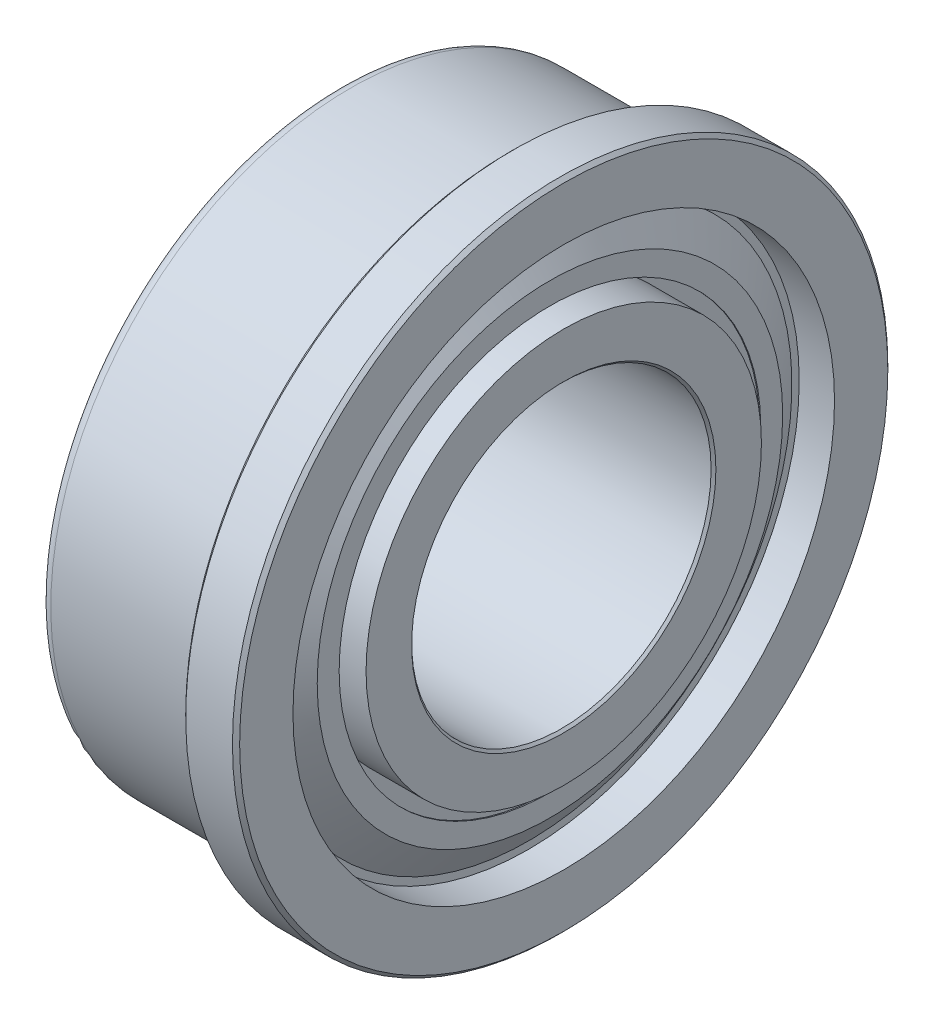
ISO-10303-21;
HEADER;
FILE_DESCRIPTION(('STEP AP214'),'2;1');
FILE_NAME('part.step','',(''),(''),'','','');
FILE_SCHEMA(('AUTOMOTIVE_DESIGN { 1 0 10303 214 1 1 1 1 }'));
ENDSEC;
DATA;
#1=APPLICATION_CONTEXT('core data for automotive mechanical design processes');
#2=APPLICATION_PROTOCOL_DEFINITION('international standard','automotive_design',2000,#1);
#3=PRODUCT_CONTEXT('',#1,'mechanical');
#4=PRODUCT('Part','Part','',(#3));
#5=PRODUCT_RELATED_PRODUCT_CATEGORY('part','',(#4));
#6=PRODUCT_DEFINITION_FORMATION('','',#4);
#7=PRODUCT_DEFINITION_CONTEXT('part definition',#1,'design');
#8=PRODUCT_DEFINITION('design','',#6,#7);
#9=PRODUCT_DEFINITION_SHAPE('','',#8);
#10=(LENGTH_UNIT() NAMED_UNIT(*) SI_UNIT(.MILLI.,.METRE.));
#11=(NAMED_UNIT(*) PLANE_ANGLE_UNIT() SI_UNIT($,.RADIAN.));
#12=(NAMED_UNIT(*) SI_UNIT($,.STERADIAN.) SOLID_ANGLE_UNIT());
#13=UNCERTAINTY_MEASURE_WITH_UNIT(LENGTH_MEASURE(1.E-05),#10,'distance_accuracy_value','');
#14=(GEOMETRIC_REPRESENTATION_CONTEXT(3) GLOBAL_UNCERTAINTY_ASSIGNED_CONTEXT((#13)) GLOBAL_UNIT_ASSIGNED_CONTEXT((#10,
#11,#12)) REPRESENTATION_CONTEXT('',''));
#15=CARTESIAN_POINT('',(0.,0.,0.));
#16=DIRECTION('',(0.,0.,1.));
#17=DIRECTION('',(1.,0.,0.));
#18=AXIS2_PLACEMENT_3D('',#15,#16,#17);
#19=CARTESIAN_POINT('',(2.38125,0.,0.));
#20=DIRECTION('',(1.,0.,0.));
#21=DIRECTION('',(0.,0.,-1.));
#22=AXIS2_PLACEMENT_3D('',#19,#20,#21);
#23=PLANE('',#22);
#24=CARTESIAN_POINT('',(2.38124999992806,0.,0.));
#25=DIRECTION('',(1.,0.,0.));
#26=DIRECTION('',(0.,0.,-1.));
#27=AXIS2_PLACEMENT_3D('',#24,#25,#26);
#28=CIRCLE('',#27,3.22580000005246);
#29=CARTESIAN_POINT('',(2.38124999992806,0.,-3.22580000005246));
#30=VERTEX_POINT('',#29);
#31=EDGE_CURVE('E184',#30,#30,#28,.F.);
#32=ORIENTED_EDGE('',*,*,#31,.T.);
#33=EDGE_LOOP('',(#32));
#34=FACE_BOUND('',#33,.T.);
#35=CARTESIAN_POINT('',(2.38125,0.,0.));
#36=DIRECTION('',(1.,0.,0.));
#37=DIRECTION('',(0.,0.,-1.));
#38=AXIS2_PLACEMENT_3D('',#35,#36,#37);
#39=CIRCLE('',#38,4.191);
#40=CARTESIAN_POINT('',(2.38125,0.,-4.191));
#41=VERTEX_POINT('',#40);
#42=EDGE_CURVE('E182',#41,#41,#39,.F.);
#43=ORIENTED_EDGE('',*,*,#42,.F.);
#44=EDGE_LOOP('',(#43));
#45=FACE_BOUND('',#44,.T.);
#46=ADVANCED_FACE('F16',(#34,#45),#23,.T.);
#47=CARTESIAN_POINT('',(2.38124999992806,0.,0.));
#48=DIRECTION('',(1.,0.,0.));
#49=DIRECTION('',(0.,0.,-1.));
#50=AXIS2_PLACEMENT_3D('',#47,#48,#49);
#51=CONICAL_SURFACE('',#50,3.22580000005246,0.785398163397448);
#52=ORIENTED_EDGE('',*,*,#31,.F.);
#53=EDGE_LOOP('',(#52));
#54=FACE_BOUND('',#53,.T.);
#55=CARTESIAN_POINT('',(2.33045,0.,0.));
#56=DIRECTION('',(1.,0.,0.));
#57=DIRECTION('',(0.,0.,-1.));
#58=AXIS2_PLACEMENT_3D('',#55,#56,#57);
#59=CIRCLE('',#58,3.175);
#60=CARTESIAN_POINT('',(2.33045,0.,-3.175));
#61=VERTEX_POINT('',#60);
#62=EDGE_CURVE('E101',#61,#61,#59,.F.);
#63=ORIENTED_EDGE('',*,*,#62,.T.);
#64=EDGE_LOOP('',(#63));
#65=FACE_BOUND('',#64,.T.);
#66=ADVANCED_FACE('F190',(#54,#65),#51,.F.);
#67=CARTESIAN_POINT('',(-2.619375,0.,0.));
#68=DIRECTION('',(1.,0.,0.));
#69=DIRECTION('',(0.,0.,-1.));
#70=AXIS2_PLACEMENT_3D('',#67,#68,#69);
#71=CYLINDRICAL_SURFACE('',#70,4.191);
#72=CARTESIAN_POINT('',(1.190625,0.,0.));
#73=DIRECTION('',(1.,0.,0.));
#74=DIRECTION('',(0.,0.,-1.));
#75=AXIS2_PLACEMENT_3D('',#72,#73,#74);
#76=CIRCLE('',#75,4.191);
#77=CARTESIAN_POINT('',(1.190625,0.,-4.191));
#78=VERTEX_POINT('',#77);
#79=EDGE_CURVE('E179',#78,#78,#76,.F.);
#80=ORIENTED_EDGE('',*,*,#79,.F.);
#81=EDGE_LOOP('',(#80));
#82=FACE_BOUND('',#81,.T.);
#83=ORIENTED_EDGE('',*,*,#42,.T.);
#84=EDGE_LOOP('',(#83));
#85=FACE_BOUND('',#84,.T.);
#86=ADVANCED_FACE('F193',(#82,#85),#71,.T.);
#87=CARTESIAN_POINT('',(-2.619375,0.,0.));
#88=DIRECTION('',(1.,0.,0.));
#89=DIRECTION('',(0.,0.,-1.));
#90=AXIS2_PLACEMENT_3D('',#87,#88,#89);
#91=CYLINDRICAL_SURFACE('',#90,3.175);
#92=ORIENTED_EDGE('',*,*,#62,.F.);
#93=EDGE_LOOP('',(#92));
#94=FACE_BOUND('',#93,.T.);
#95=CARTESIAN_POINT('',(-2.33044999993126,0.,0.));
#96=DIRECTION('',(-1.,0.,0.));
#97=DIRECTION('',(0.,1.,0.));
#98=AXIS2_PLACEMENT_3D('',#95,#96,#97);
#99=CIRCLE('',#98,3.17500000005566);
#100=CARTESIAN_POINT('',(-2.33044999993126,3.17500000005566,0.));
#101=VERTEX_POINT('',#100);
#102=EDGE_CURVE('E178',#101,#101,#99,.T.);
#103=ORIENTED_EDGE('',*,*,#102,.T.);
#104=EDGE_LOOP('',(#103));
#105=FACE_BOUND('',#104,.T.);
#106=ADVANCED_FACE('F197',(#94,#105),#91,.F.);
#107=CARTESIAN_POINT('',(1.190625,0.,0.));
#108=DIRECTION('',(1.,0.,0.));
#109=DIRECTION('',(0.,0.,-1.));
#110=AXIS2_PLACEMENT_3D('',#107,#108,#109);
#111=PLANE('',#110);
#112=ORIENTED_EDGE('',*,*,#79,.T.);
#113=EDGE_LOOP('',(#112));
#114=FACE_BOUND('',#113,.T.);
#115=CARTESIAN_POINT('',(1.190625,0.,0.));
#116=DIRECTION('',(1.,0.,0.));
#117=DIRECTION('',(0.,0.,-1.));
#118=AXIS2_PLACEMENT_3D('',#115,#116,#117);
#119=CIRCLE('',#118,5.7404);
#120=CARTESIAN_POINT('',(1.190625,0.,-5.7404));
#121=VERTEX_POINT('',#120);
#122=EDGE_CURVE('E175',#121,#121,#119,.T.);
#123=ORIENTED_EDGE('',*,*,#122,.T.);
#124=EDGE_LOOP('',(#123));
#125=FACE_BOUND('',#124,.T.);
#126=ADVANCED_FACE('F200',(#114,#125),#111,.T.);
#127=CARTESIAN_POINT('',(-2.38124999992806,0.,0.));
#128=DIRECTION('',(-1.,0.,0.));
#129=DIRECTION('',(0.,0.,1.));
#130=AXIS2_PLACEMENT_3D('',#127,#128,#129);
#131=CONICAL_SURFACE('',#130,3.22580000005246,0.785398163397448);
#132=ORIENTED_EDGE('',*,*,#102,.F.);
#133=EDGE_LOOP('',(#132));
#134=FACE_BOUND('',#133,.T.);
#135=CARTESIAN_POINT('',(-2.38124999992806,0.,0.));
#136=DIRECTION('',(-1.,0.,0.));
#137=DIRECTION('',(0.,0.,1.));
#138=AXIS2_PLACEMENT_3D('',#135,#136,#137);
#139=CIRCLE('',#138,3.22580000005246);
#140=CARTESIAN_POINT('',(-2.38124999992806,0.,3.22580000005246));
#141=VERTEX_POINT('',#140);
#142=EDGE_CURVE('E172',#141,#141,#139,.T.);
#143=ORIENTED_EDGE('',*,*,#142,.T.);
#144=EDGE_LOOP('',(#143));
#145=FACE_BOUND('',#144,.T.);
#146=ADVANCED_FACE('F309',(#134,#145),#131,.F.);
#147=CARTESIAN_POINT('',(-2.619375,0.,0.));
#148=DIRECTION('',(1.,0.,0.));
#149=DIRECTION('',(0.,0.,-1.));
#150=AXIS2_PLACEMENT_3D('',#147,#148,#149);
#151=CYLINDRICAL_SURFACE('',#150,5.7404);
#152=ORIENTED_EDGE('',*,*,#122,.F.);
#153=EDGE_LOOP('',(#152));
#154=FACE_BOUND('',#153,.T.);
#155=CARTESIAN_POINT('',(1.60734375,0.,0.));
#156=DIRECTION('',(1.,0.,0.));
#157=DIRECTION('',(0.,0.,-1.));
#158=AXIS2_PLACEMENT_3D('',#155,#156,#157);
#159=CIRCLE('',#158,5.7404);
#160=CARTESIAN_POINT('',(1.60734375,0.,-5.7404));
#161=VERTEX_POINT('',#160);
#162=EDGE_CURVE('E169',#161,#161,#159,.T.);
#163=ORIENTED_EDGE('',*,*,#162,.T.);
#164=EDGE_LOOP('',(#163));
#165=FACE_BOUND('',#164,.T.);
#166=ADVANCED_FACE('F305',(#154,#165),#151,.F.);
#167=CARTESIAN_POINT('',(-2.38125,0.,0.));
#168=DIRECTION('',(1.,0.,0.));
#169=DIRECTION('',(0.,0.,-1.));
#170=AXIS2_PLACEMENT_3D('',#167,#168,#169);
#171=PLANE('',#170);
#172=ORIENTED_EDGE('',*,*,#142,.F.);
#173=EDGE_LOOP('',(#172));
#174=FACE_BOUND('',#173,.T.);
#175=CARTESIAN_POINT('',(-2.38125,0.,0.));
#176=DIRECTION('',(1.,0.,0.));
#177=DIRECTION('',(0.,0.,-1.));
#178=AXIS2_PLACEMENT_3D('',#175,#176,#177);
#179=CIRCLE('',#178,4.191);
#180=CARTESIAN_POINT('',(-2.38125,0.,-4.191));
#181=VERTEX_POINT('',#180);
#182=EDGE_CURVE('E166',#181,#181,#179,.T.);
#183=ORIENTED_EDGE('',*,*,#182,.F.);
#184=EDGE_LOOP('',(#183));
#185=FACE_BOUND('',#184,.T.);
#186=ADVANCED_FACE('F301',(#174,#185),#171,.F.);
#187=CARTESIAN_POINT('',(1.60734375,0.,0.));
#188=DIRECTION('',(1.,0.,0.));
#189=DIRECTION('',(0.,0.,-1.));
#190=AXIS2_PLACEMENT_3D('',#187,#188,#189);
#191=PLANE('',#190);
#192=CARTESIAN_POINT('',(1.60734375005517,0.,0.));
#193=DIRECTION('',(-1.,0.,0.));
#194=DIRECTION('',(0.,0.,1.));
#195=AXIS2_PLACEMENT_3D('',#192,#193,#194);
#196=CIRCLE('',#195,5.57745141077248);
#197=CARTESIAN_POINT('',(1.60734375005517,0.,5.57745141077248));
#198=VERTEX_POINT('',#197);
#199=EDGE_CURVE('E163',#198,#198,#196,.F.);
#200=ORIENTED_EDGE('',*,*,#199,.T.);
#201=EDGE_LOOP('',(#200));
#202=FACE_BOUND('',#201,.T.);
#203=ORIENTED_EDGE('',*,*,#162,.F.);
#204=EDGE_LOOP('',(#203));
#205=FACE_BOUND('',#204,.T.);
#206=ADVANCED_FACE('F297',(#202,#205),#191,.F.);
#207=CARTESIAN_POINT('',(-2.619375,0.,0.));
#208=DIRECTION('',(1.,0.,0.));
#209=DIRECTION('',(0.,0.,-1.));
#210=AXIS2_PLACEMENT_3D('',#207,#208,#209);
#211=CYLINDRICAL_SURFACE('',#210,4.191);
#212=ORIENTED_EDGE('',*,*,#182,.T.);
#213=EDGE_LOOP('',(#212));
#214=FACE_BOUND('',#213,.T.);
#215=CARTESIAN_POINT('',(-1.190625,0.,0.));
#216=DIRECTION('',(1.,0.,0.));
#217=DIRECTION('',(0.,0.,-1.));
#218=AXIS2_PLACEMENT_3D('',#215,#216,#217);
#219=CIRCLE('',#218,4.191);
#220=CARTESIAN_POINT('',(-1.190625,0.,-4.191));
#221=VERTEX_POINT('',#220);
#222=EDGE_CURVE('E160',#221,#221,#219,.F.);
#223=ORIENTED_EDGE('',*,*,#222,.T.);
#224=EDGE_LOOP('',(#223));
#225=FACE_BOUND('',#224,.T.);
#226=ADVANCED_FACE('F293',(#214,#225),#211,.T.);
#227=CARTESIAN_POINT('',(1.60734375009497,0.,0.));
#228=DIRECTION('',(-1.,0.,0.));
#229=DIRECTION('',(0.,0.,1.));
#230=AXIS2_PLACEMENT_3D('',#227,#228,#229);
#231=CONICAL_SURFACE('',#230,5.57745141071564,0.959931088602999);
#232=ORIENTED_EDGE('',*,*,#199,.F.);
#233=EDGE_LOOP('',(#232));
#234=FACE_BOUND('',#233,.T.);
#235=CARTESIAN_POINT('',(2.0635359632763,0.,0.));
#236=DIRECTION('',(-1.,0.,0.));
#237=DIRECTION('',(0.,0.,1.));
#238=AXIS2_PLACEMENT_3D('',#235,#236,#237);
#239=CIRCLE('',#238,4.92594141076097);
#240=CARTESIAN_POINT('',(2.0635359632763,0.,4.92594141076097));
#241=VERTEX_POINT('',#240);
#242=EDGE_CURVE('E157',#241,#241,#239,.F.);
#243=ORIENTED_EDGE('',*,*,#242,.T.);
#244=EDGE_LOOP('',(#243));
#245=FACE_BOUND('',#244,.T.);
#246=ADVANCED_FACE('F289',(#234,#245),#231,.F.);
#247=CARTESIAN_POINT('',(-1.190625,0.,0.));
#248=DIRECTION('',(1.,0.,0.));
#249=DIRECTION('',(0.,0.,-1.));
#250=AXIS2_PLACEMENT_3D('',#247,#248,#249);
#251=PLANE('',#250);
#252=ORIENTED_EDGE('',*,*,#222,.F.);
#253=EDGE_LOOP('',(#252));
#254=FACE_BOUND('',#253,.T.);
#255=CARTESIAN_POINT('',(-1.190625,0.,0.));
#256=DIRECTION('',(1.,0.,0.));
#257=DIRECTION('',(0.,0.,-1.));
#258=AXIS2_PLACEMENT_3D('',#255,#256,#257);
#259=CIRCLE('',#258,5.7404);
#260=CARTESIAN_POINT('',(-1.190625,0.,-5.7404));
#261=VERTEX_POINT('',#260);
#262=EDGE_CURVE('E154',#261,#261,#259,.F.);
#263=ORIENTED_EDGE('',*,*,#262,.T.);
#264=EDGE_LOOP('',(#263));
#265=FACE_BOUND('',#264,.T.);
#266=ADVANCED_FACE('F285',(#254,#265),#251,.F.);
#267=CARTESIAN_POINT('',(2.06353596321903,0.,0.));
#268=DIRECTION('',(1.,0.,0.));
#269=DIRECTION('',(0.,0.,-1.));
#270=AXIS2_PLACEMENT_3D('',#267,#268,#269);
#271=PLANE('',#270);
#272=CARTESIAN_POINT('',(2.06353596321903,0.,0.));
#273=DIRECTION('',(1.,0.,0.));
#274=DIRECTION('',(0.,0.,-1.));
#275=AXIS2_PLACEMENT_3D('',#272,#273,#274);
#276=CIRCLE('',#275,4.46913);
#277=CARTESIAN_POINT('',(2.06353596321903,0.,-4.46913));
#278=VERTEX_POINT('',#277);
#279=EDGE_CURVE('E151',#278,#278,#276,.T.);
#280=ORIENTED_EDGE('',*,*,#279,.T.);
#281=EDGE_LOOP('',(#280));
#282=FACE_BOUND('',#281,.T.);
#283=ORIENTED_EDGE('',*,*,#242,.F.);
#284=EDGE_LOOP('',(#283));
#285=FACE_BOUND('',#284,.T.);
#286=ADVANCED_FACE('F281',(#282,#285),#271,.F.);
#287=CARTESIAN_POINT('',(-2.619375,0.,0.));
#288=DIRECTION('',(1.,0.,0.));
#289=DIRECTION('',(0.,0.,-1.));
#290=AXIS2_PLACEMENT_3D('',#287,#288,#289);
#291=CYLINDRICAL_SURFACE('',#290,5.7404);
#292=ORIENTED_EDGE('',*,*,#262,.F.);
#293=EDGE_LOOP('',(#292));
#294=FACE_BOUND('',#293,.T.);
#295=CARTESIAN_POINT('',(-1.60734375,0.,0.));
#296=DIRECTION('',(1.,0.,0.));
#297=DIRECTION('',(0.,0.,-1.));
#298=AXIS2_PLACEMENT_3D('',#295,#296,#297);
#299=CIRCLE('',#298,5.7404);
#300=CARTESIAN_POINT('',(-1.60734375,0.,-5.7404));
#301=VERTEX_POINT('',#300);
#302=EDGE_CURVE('E148',#301,#301,#299,.T.);
#303=ORIENTED_EDGE('',*,*,#302,.F.);
#304=EDGE_LOOP('',(#303));
#305=FACE_BOUND('',#304,.T.);
#306=ADVANCED_FACE('F277',(#294,#305),#291,.F.);
#307=CARTESIAN_POINT('',(1.58326413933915,0.,0.));
#308=DIRECTION('',(1.,0.,0.));
#309=DIRECTION('',(0.,0.,-1.));
#310=AXIS2_PLACEMENT_3D('',#307,#308,#309);
#311=CYLINDRICAL_SURFACE('',#310,4.46913);
#312=CARTESIAN_POINT('',(2.08893596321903,0.,0.));
#313=DIRECTION('',(1.,0.,0.));
#314=DIRECTION('',(0.,0.,-1.));
#315=AXIS2_PLACEMENT_3D('',#312,#313,#314);
#316=CIRCLE('',#315,4.46913);
#317=CARTESIAN_POINT('',(2.08893596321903,0.,-4.46913));
#318=VERTEX_POINT('',#317);
#319=EDGE_CURVE('E145',#318,#318,#316,.F.);
#320=ORIENTED_EDGE('',*,*,#319,.F.);
#321=EDGE_LOOP('',(#320));
#322=FACE_BOUND('',#321,.T.);
#323=ORIENTED_EDGE('',*,*,#279,.F.);
#324=EDGE_LOOP('',(#323));
#325=FACE_BOUND('',#324,.T.);
#326=ADVANCED_FACE('F273',(#322,#325),#311,.F.);
#327=CARTESIAN_POINT('',(-1.60734375,0.,0.));
#328=DIRECTION('',(1.,0.,0.));
#329=DIRECTION('',(0.,0.,-1.));
#330=AXIS2_PLACEMENT_3D('',#327,#328,#329);
#331=PLANE('',#330);
#332=CARTESIAN_POINT('',(-1.60734375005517,0.,0.));
#333=DIRECTION('',(1.,0.,0.));
#334=DIRECTION('',(0.,0.,-1.));
#335=AXIS2_PLACEMENT_3D('',#332,#333,#334);
#336=CIRCLE('',#335,5.57745141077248);
#337=CARTESIAN_POINT('',(-1.60734375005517,0.,-5.57745141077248));
#338=VERTEX_POINT('',#337);
#339=EDGE_CURVE('E142',#338,#338,#336,.F.);
#340=ORIENTED_EDGE('',*,*,#339,.T.);
#341=EDGE_LOOP('',(#340));
#342=FACE_BOUND('',#341,.T.);
#343=ORIENTED_EDGE('',*,*,#302,.T.);
#344=EDGE_LOOP('',(#343));
#345=FACE_BOUND('',#344,.T.);
#346=ADVANCED_FACE('F269',(#342,#345),#331,.T.);
#347=CARTESIAN_POINT('',(2.08893596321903,0.,0.));
#348=DIRECTION('',(1.,0.,0.));
#349=DIRECTION('',(0.,0.,-1.));
#350=AXIS2_PLACEMENT_3D('',#347,#348,#349);
#351=PLANE('',#350);
#352=ORIENTED_EDGE('',*,*,#319,.T.);
#353=EDGE_LOOP('',(#352));
#354=FACE_BOUND('',#353,.T.);
#355=CARTESIAN_POINT('',(2.08893596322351,0.,0.));
#356=DIRECTION('',(-1.,0.,0.));
#357=DIRECTION('',(0.,0.,1.));
#358=AXIS2_PLACEMENT_3D('',#355,#356,#357);
#359=CIRCLE('',#358,4.93394999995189);
#360=CARTESIAN_POINT('',(2.08893596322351,0.,4.93394999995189));
#361=VERTEX_POINT('',#360);
#362=EDGE_CURVE('E139',#361,#361,#359,.T.);
#363=ORIENTED_EDGE('',*,*,#362,.F.);
#364=EDGE_LOOP('',(#363));
#365=FACE_BOUND('',#364,.T.);
#366=ADVANCED_FACE('F265',(#354,#365),#351,.T.);
#367=CARTESIAN_POINT('',(-1.60734375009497,0.,0.));
#368=DIRECTION('',(1.,0.,0.));
#369=DIRECTION('',(0.,0.,-1.));
#370=AXIS2_PLACEMENT_3D('',#367,#368,#369);
#371=CONICAL_SURFACE('',#370,5.57745141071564,0.959931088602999);
#372=ORIENTED_EDGE('',*,*,#339,.F.);
#373=EDGE_LOOP('',(#372));
#374=FACE_BOUND('',#373,.T.);
#375=CARTESIAN_POINT('',(-2.0635359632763,0.,0.));
#376=DIRECTION('',(1.,0.,0.));
#377=DIRECTION('',(0.,0.,-1.));
#378=AXIS2_PLACEMENT_3D('',#375,#376,#377);
#379=CIRCLE('',#378,4.92594141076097);
#380=CARTESIAN_POINT('',(-2.0635359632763,0.,-4.92594141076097));
#381=VERTEX_POINT('',#380);
#382=EDGE_CURVE('E136',#381,#381,#379,.T.);
#383=ORIENTED_EDGE('',*,*,#382,.F.);
#384=EDGE_LOOP('',(#383));
#385=FACE_BOUND('',#384,.T.);
#386=ADVANCED_FACE('F261',(#374,#385),#371,.F.);
#387=CARTESIAN_POINT('',(1.63274375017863,0.,0.));
#388=DIRECTION('',(-1.,0.,0.));
#389=DIRECTION('',(0.,0.,1.));
#390=AXIS2_PLACEMENT_3D('',#387,#388,#389);
#391=CONICAL_SURFACE('',#390,5.58545999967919,0.959931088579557);
#392=CARTESIAN_POINT('',(1.63274374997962,0.,0.));
#393=DIRECTION('',(-1.,0.,0.));
#394=DIRECTION('',(0.,0.,1.));
#395=AXIS2_PLACEMENT_3D('',#392,#393,#394);
#396=CIRCLE('',#395,5.5854599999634);
#397=CARTESIAN_POINT('',(1.63274374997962,0.,5.5854599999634));
#398=VERTEX_POINT('',#397);
#399=EDGE_CURVE('E133',#398,#398,#396,.T.);
#400=ORIENTED_EDGE('',*,*,#399,.F.);
#401=EDGE_LOOP('',(#400));
#402=FACE_BOUND('',#401,.T.);
#403=ORIENTED_EDGE('',*,*,#362,.T.);
#404=EDGE_LOOP('',(#403));
#405=FACE_BOUND('',#404,.T.);
#406=ADVANCED_FACE('F257',(#402,#405),#391,.T.);
#407=CARTESIAN_POINT('',(-2.06353596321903,0.,0.));
#408=DIRECTION('',(1.,0.,0.));
#409=DIRECTION('',(0.,0.,-1.));
#410=AXIS2_PLACEMENT_3D('',#407,#408,#409);
#411=PLANE('',#410);
#412=CARTESIAN_POINT('',(-2.06353596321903,0.,0.));
#413=DIRECTION('',(1.,0.,0.));
#414=DIRECTION('',(0.,0.,-1.));
#415=AXIS2_PLACEMENT_3D('',#412,#413,#414);
#416=CIRCLE('',#415,4.46913);
#417=CARTESIAN_POINT('',(-2.06353596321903,0.,-4.46913));
#418=VERTEX_POINT('',#417);
#419=EDGE_CURVE('E130',#418,#418,#416,.F.);
#420=ORIENTED_EDGE('',*,*,#419,.T.);
#421=EDGE_LOOP('',(#420));
#422=FACE_BOUND('',#421,.T.);
#423=ORIENTED_EDGE('',*,*,#382,.T.);
#424=EDGE_LOOP('',(#423));
#425=FACE_BOUND('',#424,.T.);
#426=ADVANCED_FACE('F253',(#422,#425),#411,.T.);
#427=CARTESIAN_POINT('',(1.63274375,0.,0.));
#428=DIRECTION('',(1.,0.,0.));
#429=DIRECTION('',(0.,0.,-1.));
#430=AXIS2_PLACEMENT_3D('',#427,#428,#429);
#431=PLANE('',#430);
#432=ORIENTED_EDGE('',*,*,#399,.T.);
#433=EDGE_LOOP('',(#432));
#434=FACE_BOUND('',#433,.T.);
#435=CARTESIAN_POINT('',(1.63274375,0.,0.));
#436=DIRECTION('',(1.,0.,0.));
#437=DIRECTION('',(0.,0.,-1.));
#438=AXIS2_PLACEMENT_3D('',#435,#436,#437);
#439=CIRCLE('',#438,5.7404);
#440=CARTESIAN_POINT('',(1.63274375,0.,-5.7404));
#441=VERTEX_POINT('',#440);
#442=EDGE_CURVE('E127',#441,#441,#439,.T.);
#443=ORIENTED_EDGE('',*,*,#442,.T.);
#444=EDGE_LOOP('',(#443));
#445=FACE_BOUND('',#444,.T.);
#446=ADVANCED_FACE('F249',(#434,#445),#431,.T.);
#447=CARTESIAN_POINT('',(-1.58326413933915,0.,0.));
#448=DIRECTION('',(1.,0.,0.));
#449=DIRECTION('',(0.,0.,-1.));
#450=AXIS2_PLACEMENT_3D('',#447,#448,#449);
#451=CYLINDRICAL_SURFACE('',#450,4.46913);
#452=CARTESIAN_POINT('',(-2.08893596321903,0.,0.));
#453=DIRECTION('',(1.,0.,0.));
#454=DIRECTION('',(0.,0.,-1.));
#455=AXIS2_PLACEMENT_3D('',#452,#453,#454);
#456=CIRCLE('',#455,4.46913);
#457=CARTESIAN_POINT('',(-2.08893596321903,0.,-4.46913));
#458=VERTEX_POINT('',#457);
#459=EDGE_CURVE('E124',#458,#458,#456,.F.);
#460=ORIENTED_EDGE('',*,*,#459,.T.);
#461=EDGE_LOOP('',(#460));
#462=FACE_BOUND('',#461,.T.);
#463=ORIENTED_EDGE('',*,*,#419,.F.);
#464=EDGE_LOOP('',(#463));
#465=FACE_BOUND('',#464,.T.);
#466=ADVANCED_FACE('F245',(#462,#465),#451,.F.);
#467=CARTESIAN_POINT('',(-2.619375,0.,0.));
#468=DIRECTION('',(1.,0.,0.));
#469=DIRECTION('',(0.,0.,-1.));
#470=AXIS2_PLACEMENT_3D('',#467,#468,#469);
#471=CYLINDRICAL_SURFACE('',#470,5.7404);
#472=CARTESIAN_POINT('',(2.38125,0.,0.));
#473=DIRECTION('',(1.,0.,0.));
#474=DIRECTION('',(0.,0.,-1.));
#475=AXIS2_PLACEMENT_3D('',#472,#473,#474);
#476=CIRCLE('',#475,5.7404);
#477=CARTESIAN_POINT('',(2.38125,0.,-5.7404));
#478=VERTEX_POINT('',#477);
#479=EDGE_CURVE('E121',#478,#478,#476,.F.);
#480=ORIENTED_EDGE('',*,*,#479,.F.);
#481=EDGE_LOOP('',(#480));
#482=FACE_BOUND('',#481,.T.);
#483=ORIENTED_EDGE('',*,*,#442,.F.);
#484=EDGE_LOOP('',(#483));
#485=FACE_BOUND('',#484,.T.);
#486=ADVANCED_FACE('F241',(#482,#485),#471,.F.);
#487=CARTESIAN_POINT('',(-2.08893596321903,0.,0.));
#488=DIRECTION('',(1.,0.,0.));
#489=DIRECTION('',(0.,0.,-1.));
#490=AXIS2_PLACEMENT_3D('',#487,#488,#489);
#491=PLANE('',#490);
#492=ORIENTED_EDGE('',*,*,#459,.F.);
#493=EDGE_LOOP('',(#492));
#494=FACE_BOUND('',#493,.T.);
#495=CARTESIAN_POINT('',(-2.08893596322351,0.,0.));
#496=DIRECTION('',(1.,0.,0.));
#497=DIRECTION('',(0.,0.,-1.));
#498=AXIS2_PLACEMENT_3D('',#495,#496,#497);
#499=CIRCLE('',#498,4.93394999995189);
#500=CARTESIAN_POINT('',(-2.08893596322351,0.,-4.93394999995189));
#501=VERTEX_POINT('',#500);
#502=EDGE_CURVE('E118',#501,#501,#499,.T.);
#503=ORIENTED_EDGE('',*,*,#502,.F.);
#504=EDGE_LOOP('',(#503));
#505=FACE_BOUND('',#504,.T.);
#506=ADVANCED_FACE('F237',(#494,#505),#491,.F.);
#507=CARTESIAN_POINT('',(2.38125,0.,0.));
#508=DIRECTION('',(1.,0.,0.));
#509=DIRECTION('',(0.,0.,-1.));
#510=AXIS2_PLACEMENT_3D('',#507,#508,#509);
#511=PLANE('',#510);
#512=ORIENTED_EDGE('',*,*,#479,.T.);
#513=EDGE_LOOP('',(#512));
#514=FACE_BOUND('',#513,.T.);
#515=CARTESIAN_POINT('',(2.3812499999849,0.,0.));
#516=DIRECTION('',(-1.,0.,0.));
#517=DIRECTION('',(0.,0.,1.));
#518=AXIS2_PLACEMENT_3D('',#515,#516,#517);
#519=CIRCLE('',#518,6.87070000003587);
#520=CARTESIAN_POINT('',(2.3812499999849,0.,6.87070000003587));
#521=VERTEX_POINT('',#520);
#522=EDGE_CURVE('E115',#521,#521,#519,.T.);
#523=ORIENTED_EDGE('',*,*,#522,.F.);
#524=EDGE_LOOP('',(#523));
#525=FACE_BOUND('',#524,.T.);
#526=ADVANCED_FACE('F233',(#514,#525),#511,.T.);
#527=CARTESIAN_POINT('',(-1.63274375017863,0.,0.));
#528=DIRECTION('',(1.,0.,0.));
#529=DIRECTION('',(0.,0.,-1.));
#530=AXIS2_PLACEMENT_3D('',#527,#528,#529);
#531=CONICAL_SURFACE('',#530,5.58545999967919,0.959931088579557);
#532=CARTESIAN_POINT('',(-1.63274374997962,0.,0.));
#533=DIRECTION('',(1.,0.,0.));
#534=DIRECTION('',(0.,0.,-1.));
#535=AXIS2_PLACEMENT_3D('',#532,#533,#534);
#536=CIRCLE('',#535,5.5854599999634);
#537=CARTESIAN_POINT('',(-1.63274374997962,0.,-5.5854599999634));
#538=VERTEX_POINT('',#537);
#539=EDGE_CURVE('E112',#538,#538,#536,.F.);
#540=ORIENTED_EDGE('',*,*,#539,.T.);
#541=EDGE_LOOP('',(#540));
#542=FACE_BOUND('',#541,.T.);
#543=ORIENTED_EDGE('',*,*,#502,.T.);
#544=EDGE_LOOP('',(#543));
#545=FACE_BOUND('',#544,.T.);
#546=ADVANCED_FACE('F229',(#542,#545),#531,.T.);
#547=CARTESIAN_POINT('',(2.30505000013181,0.,0.));
#548=DIRECTION('',(-1.,0.,0.));
#549=DIRECTION('',(0.,0.,1.));
#550=AXIS2_PLACEMENT_3D('',#547,#548,#549);
#551=CONICAL_SURFACE('',#550,6.94689999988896,0.785398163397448);
#552=ORIENTED_EDGE('',*,*,#522,.T.);
#553=EDGE_LOOP('',(#552));
#554=FACE_BOUND('',#553,.T.);
#555=CARTESIAN_POINT('',(2.30505,0.,0.));
#556=DIRECTION('',(1.,0.,0.));
#557=DIRECTION('',(0.,0.,-1.));
#558=AXIS2_PLACEMENT_3D('',#555,#556,#557);
#559=CIRCLE('',#558,6.9469);
#560=CARTESIAN_POINT('',(2.30505,0.,-6.9469));
#561=VERTEX_POINT('',#560);
#562=EDGE_CURVE('E111',#561,#561,#559,.F.);
#563=ORIENTED_EDGE('',*,*,#562,.F.);
#564=EDGE_LOOP('',(#563));
#565=FACE_BOUND('',#564,.T.);
#566=ADVANCED_FACE('F223',(#554,#565),#551,.T.);
#567=CARTESIAN_POINT('',(-1.63274375,0.,0.));
#568=DIRECTION('',(1.,0.,0.));
#569=DIRECTION('',(0.,0.,-1.));
#570=AXIS2_PLACEMENT_3D('',#567,#568,#569);
#571=PLANE('',#570);
#572=ORIENTED_EDGE('',*,*,#539,.F.);
#573=EDGE_LOOP('',(#572));
#574=FACE_BOUND('',#573,.T.);
#575=CARTESIAN_POINT('',(-1.63274375,0.,0.));
#576=DIRECTION('',(1.,0.,0.));
#577=DIRECTION('',(0.,0.,-1.));
#578=AXIS2_PLACEMENT_3D('',#575,#576,#577);
#579=CIRCLE('',#578,5.7404);
#580=CARTESIAN_POINT('',(-1.63274375,0.,-5.7404));
#581=VERTEX_POINT('',#580);
#582=EDGE_CURVE('E108',#581,#581,#579,.F.);
#583=ORIENTED_EDGE('',*,*,#582,.T.);
#584=EDGE_LOOP('',(#583));
#585=FACE_BOUND('',#584,.T.);
#586=ADVANCED_FACE('F215',(#574,#585),#571,.F.);
#587=CARTESIAN_POINT('',(-2.619375,0.,0.));
#588=DIRECTION('',(1.,0.,0.));
#589=DIRECTION('',(0.,0.,-1.));
#590=AXIS2_PLACEMENT_3D('',#587,#588,#589);
#591=CYLINDRICAL_SURFACE('',#590,6.9469);
#592=ORIENTED_EDGE('',*,*,#562,.T.);
#593=EDGE_LOOP('',(#592));
#594=FACE_BOUND('',#593,.T.);
#595=CARTESIAN_POINT('',(1.31444999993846,0.,0.));
#596=DIRECTION('',(1.,0.,0.));
#597=DIRECTION('',(0.,-1.,0.));
#598=AXIS2_PLACEMENT_3D('',#595,#596,#597);
#599=CIRCLE('',#598,6.94690000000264);
#600=CARTESIAN_POINT('',(1.31444999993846,-6.94690000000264,0.));
#601=VERTEX_POINT('',#600);
#602=EDGE_CURVE('E107',#601,#601,#599,.F.);
#603=ORIENTED_EDGE('',*,*,#602,.F.);
#604=EDGE_LOOP('',(#603));
#605=FACE_BOUND('',#604,.T.);
#606=ADVANCED_FACE('F212',(#594,#605),#591,.T.);
#607=CARTESIAN_POINT('',(-2.619375,0.,0.));
#608=DIRECTION('',(1.,0.,0.));
#609=DIRECTION('',(0.,0.,-1.));
#610=AXIS2_PLACEMENT_3D('',#607,#608,#609);
#611=CYLINDRICAL_SURFACE('',#610,5.7404);
#612=CARTESIAN_POINT('',(-2.38125,0.,0.));
#613=DIRECTION('',(1.,0.,0.));
#614=DIRECTION('',(0.,0.,-1.));
#615=AXIS2_PLACEMENT_3D('',#612,#613,#614);
#616=CIRCLE('',#615,5.7404);
#617=CARTESIAN_POINT('',(-2.38125,0.,-5.7404));
#618=VERTEX_POINT('',#617);
#619=EDGE_CURVE('E42',#618,#618,#616,.F.);
#620=ORIENTED_EDGE('',*,*,#619,.T.);
#621=EDGE_LOOP('',(#620));
#622=FACE_BOUND('',#621,.T.);
#623=ORIENTED_EDGE('',*,*,#582,.F.);
#624=EDGE_LOOP('',(#623));
#625=FACE_BOUND('',#624,.T.);
#626=ADVANCED_FACE('F214',(#622,#625),#611,.F.);
#627=CARTESIAN_POINT('',(1.31444999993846,0.,0.));
#628=DIRECTION('',(1.,0.,0.));
#629=DIRECTION('',(0.,0.,-1.));
#630=AXIS2_PLACEMENT_3D('',#627,#628,#629);
#631=CONICAL_SURFACE('',#630,6.94690000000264,0.785398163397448);
#632=ORIENTED_EDGE('',*,*,#602,.T.);
#633=EDGE_LOOP('',(#632));
#634=FACE_BOUND('',#633,.T.);
#635=CARTESIAN_POINT('',(1.23824999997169,0.,0.));
#636=DIRECTION('',(1.,0.,0.));
#637=DIRECTION('',(0.,0.,-1.));
#638=AXIS2_PLACEMENT_3D('',#635,#636,#637);
#639=CIRCLE('',#638,6.87070000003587);
#640=CARTESIAN_POINT('',(1.23824999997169,0.,-6.87070000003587));
#641=VERTEX_POINT('',#640);
#642=EDGE_CURVE('E41',#641,#641,#639,.T.);
#643=ORIENTED_EDGE('',*,*,#642,.T.);
#644=EDGE_LOOP('',(#643));
#645=FACE_BOUND('',#644,.T.);
#646=ADVANCED_FACE('F63',(#634,#645),#631,.T.);
#647=CARTESIAN_POINT('',(-2.38125,0.,0.));
#648=DIRECTION('',(1.,0.,0.));
#649=DIRECTION('',(0.,0.,-1.));
#650=AXIS2_PLACEMENT_3D('',#647,#648,#649);
#651=PLANE('',#650);
#652=ORIENTED_EDGE('',*,*,#619,.F.);
#653=EDGE_LOOP('',(#652));
#654=FACE_BOUND('',#653,.T.);
#655=CARTESIAN_POINT('',(-2.38125,0.,0.));
#656=DIRECTION('',(1.,0.,0.));
#657=DIRECTION('',(0.,-1.,0.));
#658=AXIS2_PLACEMENT_3D('',#655,#656,#657);
#659=CIRCLE('',#658,6.111875);
#660=CARTESIAN_POINT('',(-2.38125,-6.111875,0.));
#661=VERTEX_POINT('',#660);
#662=CARTESIAN_POINT('',(-2.38125,6.111875,0.));
#663=VERTEX_POINT('',#662);
#664=EDGE_CURVE('E39',#661,#663,#659,.T.);
#665=ORIENTED_EDGE('',*,*,#664,.F.);
#666=CARTESIAN_POINT('',(-2.38125,0.,0.));
#667=DIRECTION('',(1.,0.,0.));
#668=DIRECTION('',(0.,1.,0.));
#669=AXIS2_PLACEMENT_3D('',#666,#667,#668);
#670=CIRCLE('',#669,6.111875);
#671=EDGE_CURVE('E33',#663,#661,#670,.T.);
#672=ORIENTED_EDGE('',*,*,#671,.F.);
#673=EDGE_LOOP('',(#665,#672));
#674=FACE_BOUND('',#673,.T.);
#675=ADVANCED_FACE('F45',(#654,#674),#651,.F.);
#676=CARTESIAN_POINT('',(1.23825,0.,0.));
#677=DIRECTION('',(1.,0.,0.));
#678=DIRECTION('',(0.,0.,-1.));
#679=AXIS2_PLACEMENT_3D('',#676,#677,#678);
#680=PLANE('',#679);
#681=CARTESIAN_POINT('',(1.23825,0.,0.));
#682=DIRECTION('',(1.,0.,0.));
#683=DIRECTION('',(0.,0.,-1.));
#684=AXIS2_PLACEMENT_3D('',#681,#682,#683);
#685=CIRCLE('',#684,6.35);
#686=CARTESIAN_POINT('',(1.23825,0.,-6.35));
#687=VERTEX_POINT('',#686);
#688=EDGE_CURVE('E26',#687,#687,#685,.F.);
#689=ORIENTED_EDGE('',*,*,#688,.F.);
#690=EDGE_LOOP('',(#689));
#691=FACE_BOUND('',#690,.T.);
#692=ORIENTED_EDGE('',*,*,#642,.F.);
#693=EDGE_LOOP('',(#692));
#694=FACE_BOUND('',#693,.T.);
#695=ADVANCED_FACE('F62',(#691,#694),#680,.F.);
#696=CARTESIAN_POINT('',(-2.143125,0.,0.));
#697=DIRECTION('',(1.,0.,0.));
#698=DIRECTION('',(0.,-1.,0.));
#699=AXIS2_PLACEMENT_3D('',#696,#697,#698);
#700=TOROIDAL_SURFACE('',#699,6.111875,0.238125);
#701=ORIENTED_EDGE('',*,*,#671,.T.);
#702=ORIENTED_EDGE('',*,*,#664,.T.);
#703=EDGE_LOOP('',(#701,#702));
#704=FACE_BOUND('',#703,.T.);
#705=CARTESIAN_POINT('',(-2.143125,0.,0.));
#706=DIRECTION('',(1.,0.,0.));
#707=DIRECTION('',(0.,0.,-1.));
#708=AXIS2_PLACEMENT_3D('',#705,#706,#707);
#709=CIRCLE('',#708,6.35);
#710=CARTESIAN_POINT('',(-2.143125,0.,-6.35));
#711=VERTEX_POINT('',#710);
#712=EDGE_CURVE('E10',#711,#711,#709,.T.);
#713=ORIENTED_EDGE('',*,*,#712,.F.);
#714=EDGE_LOOP('',(#713));
#715=FACE_BOUND('',#714,.T.);
#716=ADVANCED_FACE('F37',(#704,#715),#700,.T.);
#717=CARTESIAN_POINT('',(-2.619375,0.,0.));
#718=DIRECTION('',(1.,0.,0.));
#719=DIRECTION('',(0.,0.,-1.));
#720=AXIS2_PLACEMENT_3D('',#717,#718,#719);
#721=CYLINDRICAL_SURFACE('',#720,6.35);
#722=ORIENTED_EDGE('',*,*,#712,.T.);
#723=EDGE_LOOP('',(#722));
#724=FACE_BOUND('',#723,.T.);
#725=ORIENTED_EDGE('',*,*,#688,.T.);
#726=EDGE_LOOP('',(#725));
#727=FACE_BOUND('',#726,.T.);
#728=ADVANCED_FACE('F86',(#724,#727),#721,.T.);
#729=CLOSED_SHELL('',(#46,#66,#86,#106,#126,#146,#166,#186,#206,#226,#246,#266,#286,#306,#326,
#346,#366,#386,#406,#426,#446,#466,#486,#506,#526,#546,#566,#586,#606,#626,#646,#675,#695,#716,#728));
#730=MANIFOLD_SOLID_BREP('B1',#729);
#731=ADVANCED_BREP_SHAPE_REPRESENTATION('',(#18,#730),#14);
#732=SHAPE_DEFINITION_REPRESENTATION(#9,#731);
ENDSEC;
END-ISO-10303-21;
